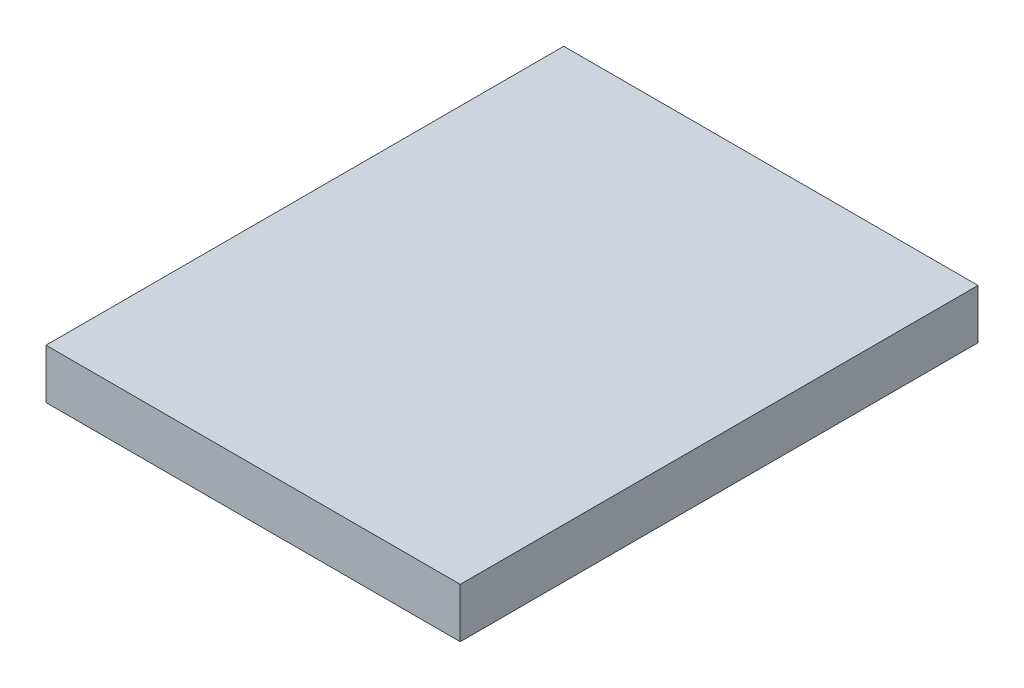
ISO-10303-21;
HEADER;
FILE_DESCRIPTION(('STEP AP214'),'2;1');
FILE_NAME('part.step','',(''),(''),'','','');
FILE_SCHEMA(('AUTOMOTIVE_DESIGN { 1 0 10303 214 1 1 1 1 }'));
ENDSEC;
DATA;
#1=APPLICATION_CONTEXT('core data for automotive mechanical design processes');
#2=APPLICATION_PROTOCOL_DEFINITION('international standard','automotive_design',2000,#1);
#3=PRODUCT_CONTEXT('',#1,'mechanical');
#4=PRODUCT('Part','Part','',(#3));
#5=PRODUCT_RELATED_PRODUCT_CATEGORY('part','',(#4));
#6=PRODUCT_DEFINITION_FORMATION('','',#4);
#7=PRODUCT_DEFINITION_CONTEXT('part definition',#1,'design');
#8=PRODUCT_DEFINITION('design','',#6,#7);
#9=PRODUCT_DEFINITION_SHAPE('','',#8);
#10=(LENGTH_UNIT() NAMED_UNIT(*) SI_UNIT(.MILLI.,.METRE.));
#11=(NAMED_UNIT(*) PLANE_ANGLE_UNIT() SI_UNIT($,.RADIAN.));
#12=(NAMED_UNIT(*) SI_UNIT($,.STERADIAN.) SOLID_ANGLE_UNIT());
#13=UNCERTAINTY_MEASURE_WITH_UNIT(LENGTH_MEASURE(1.E-05),#10,'distance_accuracy_value','');
#14=(GEOMETRIC_REPRESENTATION_CONTEXT(3) GLOBAL_UNCERTAINTY_ASSIGNED_CONTEXT((#13)) GLOBAL_UNIT_ASSIGNED_CONTEXT((#10,
#11,#12)) REPRESENTATION_CONTEXT('',''));
#15=CARTESIAN_POINT('',(0.,0.,0.));
#16=DIRECTION('',(0.,0.,1.));
#17=DIRECTION('',(1.,0.,0.));
#18=AXIS2_PLACEMENT_3D('',#15,#16,#17);
#19=CARTESIAN_POINT('',(0.,0.,125.));
#20=DIRECTION('',(1.,0.,0.));
#21=DIRECTION('',(0.,1.,0.));
#22=AXIS2_PLACEMENT_3D('',#19,#20,#21);
#23=PLANE('',#22);
#24=DIRECTION('',(0.,-1.,0.));
#25=VECTOR('',#24,1.);
#26=CARTESIAN_POINT('',(0.,0.,0.));
#27=LINE('',#26,#25);
#28=CARTESIAN_POINT('',(0.,0.,0.));
#29=VERTEX_POINT('',#28);
#30=CARTESIAN_POINT('',(0.,-12.,0.));
#31=VERTEX_POINT('',#30);
#32=EDGE_CURVE('E75',#29,#31,#27,.T.);
#33=ORIENTED_EDGE('',*,*,#32,.T.);
#34=DIRECTION('',(0.,0.,-1.));
#35=VECTOR('',#34,1.);
#36=CARTESIAN_POINT('',(0.,-12.,125.));
#37=LINE('',#36,#35);
#38=CARTESIAN_POINT('',(0.,-12.,125.));
#39=VERTEX_POINT('',#38);
#40=EDGE_CURVE('E11',#39,#31,#37,.T.);
#41=ORIENTED_EDGE('',*,*,#40,.F.);
#42=DIRECTION('',(0.,-1.,0.));
#43=VECTOR('',#42,1.);
#44=CARTESIAN_POINT('',(0.,0.,125.));
#45=LINE('',#44,#43);
#46=CARTESIAN_POINT('',(0.,0.,125.));
#47=VERTEX_POINT('',#46);
#48=EDGE_CURVE('E93',#47,#39,#45,.T.);
#49=ORIENTED_EDGE('',*,*,#48,.F.);
#50=DIRECTION('',(0.,0.,-1.));
#51=VECTOR('',#50,1.);
#52=CARTESIAN_POINT('',(0.,0.,125.));
#53=LINE('',#52,#51);
#54=EDGE_CURVE('E87',#47,#29,#53,.T.);
#55=ORIENTED_EDGE('',*,*,#54,.T.);
#56=EDGE_LOOP('',(#33,#41,#49,#55));
#57=FACE_BOUND('',#56,.T.);
#58=ADVANCED_FACE('F31',(#57),#23,.F.);
#59=CARTESIAN_POINT('',(0.,-12.,125.));
#60=DIRECTION('',(0.,1.,0.));
#61=DIRECTION('',(0.,0.,1.));
#62=AXIS2_PLACEMENT_3D('',#59,#60,#61);
#63=PLANE('',#62);
#64=DIRECTION('',(1.,0.,0.));
#65=VECTOR('',#64,1.);
#66=CARTESIAN_POINT('',(0.,-12.,0.));
#67=LINE('',#66,#65);
#68=CARTESIAN_POINT('',(100.,-12.,0.));
#69=VERTEX_POINT('',#68);
#70=EDGE_CURVE('E71',#31,#69,#67,.T.);
#71=ORIENTED_EDGE('',*,*,#70,.T.);
#72=DIRECTION('',(0.,0.,-1.));
#73=VECTOR('',#72,1.);
#74=CARTESIAN_POINT('',(100.,-12.,125.));
#75=LINE('',#74,#73);
#76=CARTESIAN_POINT('',(100.,-12.,125.));
#77=VERTEX_POINT('',#76);
#78=EDGE_CURVE('E38',#77,#69,#75,.T.);
#79=ORIENTED_EDGE('',*,*,#78,.F.);
#80=DIRECTION('',(1.,0.,0.));
#81=VECTOR('',#80,1.);
#82=CARTESIAN_POINT('',(0.,-12.,125.));
#83=LINE('',#82,#81);
#84=EDGE_CURVE('E83',#39,#77,#83,.T.);
#85=ORIENTED_EDGE('',*,*,#84,.F.);
#86=ORIENTED_EDGE('',*,*,#40,.T.);
#87=EDGE_LOOP('',(#71,#79,#85,#86));
#88=FACE_BOUND('',#87,.T.);
#89=ADVANCED_FACE('F82',(#88),#63,.F.);
#90=CARTESIAN_POINT('',(100.,0.,125.));
#91=DIRECTION('',(-1.,0.,0.));
#92=DIRECTION('',(0.,0.,1.));
#93=AXIS2_PLACEMENT_3D('',#90,#91,#92);
#94=PLANE('',#93);
#95=DIRECTION('',(0.,1.,0.));
#96=VECTOR('',#95,1.);
#97=CARTESIAN_POINT('',(100.,0.,0.));
#98=LINE('',#97,#96);
#99=CARTESIAN_POINT('',(100.,0.,0.));
#100=VERTEX_POINT('',#99);
#101=EDGE_CURVE('E76',#69,#100,#98,.T.);
#102=ORIENTED_EDGE('',*,*,#101,.T.);
#103=DIRECTION('',(0.,0.,-1.));
#104=VECTOR('',#103,1.);
#105=CARTESIAN_POINT('',(100.,0.,125.));
#106=LINE('',#105,#104);
#107=CARTESIAN_POINT('',(100.,0.,125.));
#108=VERTEX_POINT('',#107);
#109=EDGE_CURVE('E99',#108,#100,#106,.T.);
#110=ORIENTED_EDGE('',*,*,#109,.F.);
#111=DIRECTION('',(0.,1.,0.));
#112=VECTOR('',#111,1.);
#113=CARTESIAN_POINT('',(100.,0.,125.));
#114=LINE('',#113,#112);
#115=EDGE_CURVE('E50',#77,#108,#114,.T.);
#116=ORIENTED_EDGE('',*,*,#115,.F.);
#117=ORIENTED_EDGE('',*,*,#78,.T.);
#118=EDGE_LOOP('',(#102,#110,#116,#117));
#119=FACE_BOUND('',#118,.T.);
#120=ADVANCED_FACE('F102',(#119),#94,.F.);
#121=CARTESIAN_POINT('',(0.,0.,125.));
#122=DIRECTION('',(0.,-1.,0.));
#123=DIRECTION('',(0.,0.,-1.));
#124=AXIS2_PLACEMENT_3D('',#121,#122,#123);
#125=PLANE('',#124);
#126=DIRECTION('',(-1.,0.,0.));
#127=VECTOR('',#126,1.);
#128=CARTESIAN_POINT('',(0.,0.,0.));
#129=LINE('',#128,#127);
#130=EDGE_CURVE('E91',#100,#29,#129,.T.);
#131=ORIENTED_EDGE('',*,*,#130,.T.);
#132=ORIENTED_EDGE('',*,*,#54,.F.);
#133=DIRECTION('',(-1.,0.,0.));
#134=VECTOR('',#133,1.);
#135=CARTESIAN_POINT('',(0.,0.,125.));
#136=LINE('',#135,#134);
#137=EDGE_CURVE('E45',#108,#47,#136,.T.);
#138=ORIENTED_EDGE('',*,*,#137,.F.);
#139=ORIENTED_EDGE('',*,*,#109,.T.);
#140=EDGE_LOOP('',(#131,#132,#138,#139));
#141=FACE_BOUND('',#140,.T.);
#142=ADVANCED_FACE('F104',(#141),#125,.F.);
#143=CARTESIAN_POINT('',(0.,-12.,125.));
#144=DIRECTION('',(0.,0.,1.));
#145=DIRECTION('',(1.,0.,0.));
#146=AXIS2_PLACEMENT_3D('',#143,#144,#145);
#147=PLANE('',#146);
#148=ORIENTED_EDGE('',*,*,#48,.T.);
#149=ORIENTED_EDGE('',*,*,#84,.T.);
#150=ORIENTED_EDGE('',*,*,#115,.T.);
#151=ORIENTED_EDGE('',*,*,#137,.T.);
#152=EDGE_LOOP('',(#148,#149,#150,#151));
#153=FACE_BOUND('',#152,.T.);
#154=ADVANCED_FACE('F105',(#153),#147,.T.);
#155=CARTESIAN_POINT('',(0.,-12.,0.));
#156=DIRECTION('',(0.,0.,1.));
#157=DIRECTION('',(1.,0.,0.));
#158=AXIS2_PLACEMENT_3D('',#155,#156,#157);
#159=PLANE('',#158);
#160=ORIENTED_EDGE('',*,*,#32,.F.);
#161=ORIENTED_EDGE('',*,*,#130,.F.);
#162=ORIENTED_EDGE('',*,*,#101,.F.);
#163=ORIENTED_EDGE('',*,*,#70,.F.);
#164=EDGE_LOOP('',(#160,#161,#162,#163));
#165=FACE_BOUND('',#164,.T.);
#166=ADVANCED_FACE('F72',(#165),#159,.F.);
#167=CLOSED_SHELL('',(#58,#89,#120,#142,#154,#166));
#168=MANIFOLD_SOLID_BREP('B2',#167);
#169=ADVANCED_BREP_SHAPE_REPRESENTATION('',(#18,#168),#14);
#170=SHAPE_DEFINITION_REPRESENTATION(#9,#169);
ENDSEC;
END-ISO-10303-21;
